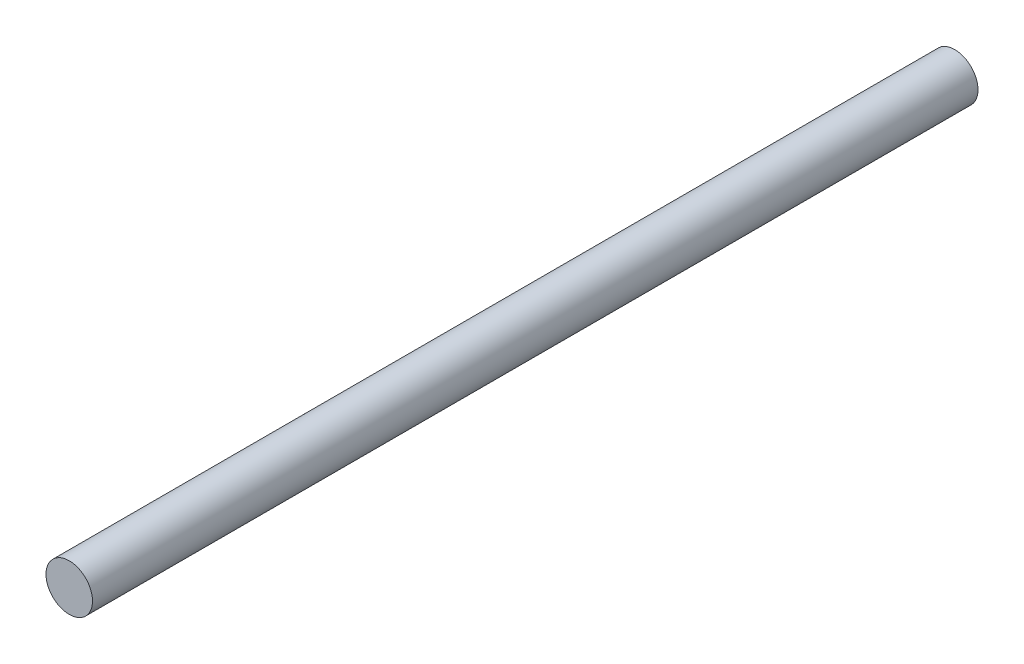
ISO-10303-21;
HEADER;
FILE_DESCRIPTION(('STEP AP214'),'2;1');
FILE_NAME('part.step','',(''),(''),'','','');
FILE_SCHEMA(('AUTOMOTIVE_DESIGN { 1 0 10303 214 1 1 1 1 }'));
ENDSEC;
DATA;
#1=APPLICATION_CONTEXT('core data for automotive mechanical design processes');
#2=APPLICATION_PROTOCOL_DEFINITION('international standard','automotive_design',2000,#1);
#3=PRODUCT_CONTEXT('',#1,'mechanical');
#4=PRODUCT('Part','Part','',(#3));
#5=PRODUCT_RELATED_PRODUCT_CATEGORY('part','',(#4));
#6=PRODUCT_DEFINITION_FORMATION('','',#4);
#7=PRODUCT_DEFINITION_CONTEXT('part definition',#1,'design');
#8=PRODUCT_DEFINITION('design','',#6,#7);
#9=PRODUCT_DEFINITION_SHAPE('','',#8);
#10=(LENGTH_UNIT() NAMED_UNIT(*) SI_UNIT(.MILLI.,.METRE.));
#11=(NAMED_UNIT(*) PLANE_ANGLE_UNIT() SI_UNIT($,.RADIAN.));
#12=(NAMED_UNIT(*) SI_UNIT($,.STERADIAN.) SOLID_ANGLE_UNIT());
#13=UNCERTAINTY_MEASURE_WITH_UNIT(LENGTH_MEASURE(1.E-05),#10,'distance_accuracy_value','');
#14=(GEOMETRIC_REPRESENTATION_CONTEXT(3) GLOBAL_UNCERTAINTY_ASSIGNED_CONTEXT((#13)) GLOBAL_UNIT_ASSIGNED_CONTEXT((#10,
#11,#12)) REPRESENTATION_CONTEXT('',''));
#15=CARTESIAN_POINT('',(0.,0.,0.));
#16=DIRECTION('',(0.,0.,1.));
#17=DIRECTION('',(1.,0.,0.));
#18=AXIS2_PLACEMENT_3D('',#15,#16,#17);
#19=CARTESIAN_POINT('',(0.,0.,399.298972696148));
#20=DIRECTION('',(0.,0.,-1.));
#21=DIRECTION('',(-1.,0.,0.));
#22=AXIS2_PLACEMENT_3D('',#19,#20,#21);
#23=CYLINDRICAL_SURFACE('',#22,18.25625);
#24=CARTESIAN_POINT('',(0.,0.,347.6625));
#25=DIRECTION('',(0.,0.,1.));
#26=DIRECTION('',(0.,-1.,0.));
#27=AXIS2_PLACEMENT_3D('',#24,#25,#26);
#28=CIRCLE('',#27,18.25625);
#29=CARTESIAN_POINT('',(0.,-18.25625,347.6625));
#30=VERTEX_POINT('',#29);
#31=EDGE_CURVE('E10',#30,#30,#28,.T.);
#32=ORIENTED_EDGE('',*,*,#31,.F.);
#33=EDGE_LOOP('',(#32));
#34=FACE_BOUND('',#33,.T.);
#35=CARTESIAN_POINT('',(0.,0.,-347.6625));
#36=DIRECTION('',(0.,0.,-1.));
#37=DIRECTION('',(0.,1.,0.));
#38=AXIS2_PLACEMENT_3D('',#35,#36,#37);
#39=CIRCLE('',#38,18.25625);
#40=CARTESIAN_POINT('',(0.,18.25625,-347.6625));
#41=VERTEX_POINT('',#40);
#42=EDGE_CURVE('E45',#41,#41,#39,.F.);
#43=ORIENTED_EDGE('',*,*,#42,.T.);
#44=EDGE_LOOP('',(#43));
#45=FACE_BOUND('',#44,.T.);
#46=ADVANCED_FACE('F37',(#34,#45),#23,.T.);
#47=CARTESIAN_POINT('',(-4.18751921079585E-13,0.,347.6625));
#48=DIRECTION('',(0.,0.,1.));
#49=DIRECTION('',(0.,-1.,0.));
#50=AXIS2_PLACEMENT_3D('',#47,#48,#49);
#51=PLANE('',#50);
#52=ORIENTED_EDGE('',*,*,#31,.T.);
#53=EDGE_LOOP('',(#52));
#54=FACE_BOUND('',#53,.T.);
#55=ADVANCED_FACE('F39',(#54),#51,.T.);
#56=CARTESIAN_POINT('',(-4.14881617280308E-13,2.13092283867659E-13,-347.6625));
#57=DIRECTION('',(0.,0.,-1.));
#58=DIRECTION('',(0.,1.,0.));
#59=AXIS2_PLACEMENT_3D('',#56,#57,#58);
#60=PLANE('',#59);
#61=ORIENTED_EDGE('',*,*,#42,.F.);
#62=EDGE_LOOP('',(#61));
#63=FACE_BOUND('',#62,.T.);
#64=ADVANCED_FACE('F55',(#63),#60,.T.);
#65=CLOSED_SHELL('',(#46,#55,#64));
#66=MANIFOLD_SOLID_BREP('B2',#65);
#67=ADVANCED_BREP_SHAPE_REPRESENTATION('',(#18,#66),#14);
#68=SHAPE_DEFINITION_REPRESENTATION(#9,#67);
ENDSEC;
END-ISO-10303-21;
